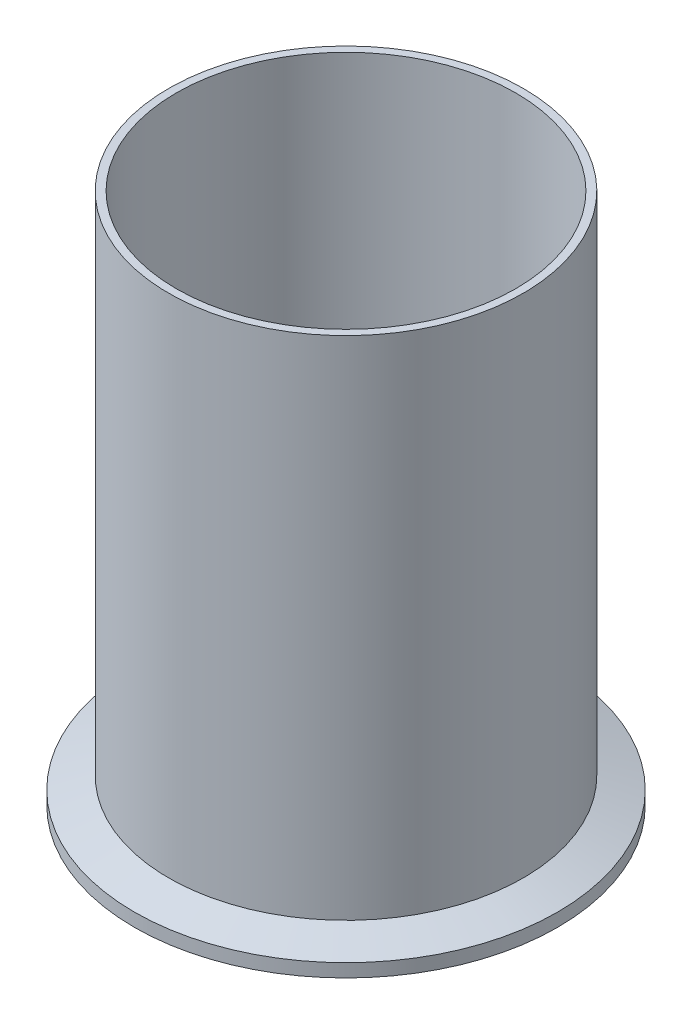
ISO-10303-21;
HEADER;
FILE_DESCRIPTION(('STEP AP214'),'2;1');
FILE_NAME('part.step','',(''),(''),'','','');
FILE_SCHEMA(('AUTOMOTIVE_DESIGN { 1 0 10303 214 1 1 1 1 }'));
ENDSEC;
DATA;
#1=APPLICATION_CONTEXT('core data for automotive mechanical design processes');
#2=APPLICATION_PROTOCOL_DEFINITION('international standard','automotive_design',2000,#1);
#3=PRODUCT_CONTEXT('',#1,'mechanical');
#4=PRODUCT('Part','Part','',(#3));
#5=PRODUCT_RELATED_PRODUCT_CATEGORY('part','',(#4));
#6=PRODUCT_DEFINITION_FORMATION('','',#4);
#7=PRODUCT_DEFINITION_CONTEXT('part definition',#1,'design');
#8=PRODUCT_DEFINITION('design','',#6,#7);
#9=PRODUCT_DEFINITION_SHAPE('','',#8);
#10=(LENGTH_UNIT() NAMED_UNIT(*) SI_UNIT(.MILLI.,.METRE.));
#11=(NAMED_UNIT(*) PLANE_ANGLE_UNIT() SI_UNIT($,.RADIAN.));
#12=(NAMED_UNIT(*) SI_UNIT($,.STERADIAN.) SOLID_ANGLE_UNIT());
#13=UNCERTAINTY_MEASURE_WITH_UNIT(LENGTH_MEASURE(1.E-05),#10,'distance_accuracy_value','');
#14=(GEOMETRIC_REPRESENTATION_CONTEXT(3) GLOBAL_UNCERTAINTY_ASSIGNED_CONTEXT((#13)) GLOBAL_UNIT_ASSIGNED_CONTEXT((#10,
#11,#12)) REPRESENTATION_CONTEXT('',''));
#15=CARTESIAN_POINT('',(0.,0.,0.));
#16=DIRECTION('',(0.,0.,1.));
#17=DIRECTION('',(1.,0.,0.));
#18=AXIS2_PLACEMENT_3D('',#15,#16,#17);
#19=CARTESIAN_POINT('',(0.,0.7874,0.));
#20=DIRECTION('',(0.,-1.,0.));
#21=DIRECTION('',(0.,0.,-1.));
#22=AXIS2_PLACEMENT_3D('',#19,#20,#21);
#23=TOROIDAL_SURFACE('',#22,43.4867084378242,0.787400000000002);
#24=CARTESIAN_POINT('',(0.,0.,0.));
#25=DIRECTION('',(0.,-1.,0.));
#26=DIRECTION('',(0.,0.,-1.));
#27=AXIS2_PLACEMENT_3D('',#24,#25,#26);
#28=CIRCLE('',#27,43.4867084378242);
#29=CARTESIAN_POINT('',(0.,0.,-43.4867084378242));
#30=VERTEX_POINT('',#29);
#31=EDGE_CURVE('E67',#30,#30,#28,.T.);
#32=ORIENTED_EDGE('',*,*,#31,.T.);
#33=EDGE_LOOP('',(#32));
#34=FACE_BOUND('',#33,.T.);
#35=CARTESIAN_POINT('',(0.,0.474458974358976,0.));
#36=DIRECTION('',(0.,-1.,0.));
#37=DIRECTION('',(0.,0.,-1.));
#38=AXIS2_PLACEMENT_3D('',#35,#36,#37);
#39=CIRCLE('',#38,42.7641666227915);
#40=CARTESIAN_POINT('',(0.,0.474458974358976,-42.7641666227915));
#41=VERTEX_POINT('',#40);
#42=EDGE_CURVE('E10',#41,#41,#39,.T.);
#43=ORIENTED_EDGE('',*,*,#42,.F.);
#44=EDGE_LOOP('',(#43));
#45=FACE_BOUND('',#44,.T.);
#46=ADVANCED_FACE('F33',(#34,#45),#23,.T.);
#47=CARTESIAN_POINT('',(0.,0.,0.));
#48=DIRECTION('',(0.,-1.,0.));
#49=DIRECTION('',(0.,0.,-1.));
#50=AXIS2_PLACEMENT_3D('',#47,#48,#49);
#51=TOROIDAL_SURFACE('',#50,41.6687,1.1938);
#52=CARTESIAN_POINT('',(0.,0.474458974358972,0.));
#53=DIRECTION('',(0.,-1.,0.));
#54=DIRECTION('',(0.,0.,-1.));
#55=AXIS2_PLACEMENT_3D('',#52,#53,#54);
#56=CIRCLE('',#55,40.5732333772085);
#57=CARTESIAN_POINT('',(0.,0.474458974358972,-40.5732333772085));
#58=VERTEX_POINT('',#57);
#59=EDGE_CURVE('E39',#58,#58,#56,.T.);
#60=ORIENTED_EDGE('',*,*,#59,.F.);
#61=EDGE_LOOP('',(#60));
#62=FACE_BOUND('',#61,.T.);
#63=ORIENTED_EDGE('',*,*,#42,.T.);
#64=EDGE_LOOP('',(#63));
#65=FACE_BOUND('',#64,.T.);
#66=ADVANCED_FACE('F115',(#62,#65),#51,.F.);
#67=CARTESIAN_POINT('',(0.,0.7874,0.));
#68=DIRECTION('',(0.,-1.,0.));
#69=DIRECTION('',(0.,0.,-1.));
#70=AXIS2_PLACEMENT_3D('',#67,#68,#69);
#71=TOROIDAL_SURFACE('',#70,39.8506915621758,0.787399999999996);
#72=ORIENTED_EDGE('',*,*,#59,.T.);
#73=EDGE_LOOP('',(#72));
#74=FACE_BOUND('',#73,.T.);
#75=CARTESIAN_POINT('',(0.,0.,0.));
#76=DIRECTION('',(0.,-1.,0.));
#77=DIRECTION('',(0.,0.,-1.));
#78=AXIS2_PLACEMENT_3D('',#75,#76,#77);
#79=CIRCLE('',#78,39.8506915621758);
#80=CARTESIAN_POINT('',(0.,0.,-39.8506915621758));
#81=VERTEX_POINT('',#80);
#82=EDGE_CURVE('E43',#81,#81,#79,.T.);
#83=ORIENTED_EDGE('',*,*,#82,.F.);
#84=EDGE_LOOP('',(#83));
#85=FACE_BOUND('',#84,.T.);
#86=ADVANCED_FACE('F111',(#74,#85),#71,.T.);
#87=CARTESIAN_POINT('',(0.,0.,0.));
#88=DIRECTION('',(0.,1.,0.));
#89=DIRECTION('',(0.,0.,1.));
#90=AXIS2_PLACEMENT_3D('',#87,#88,#89);
#91=PLANE('',#90);
#92=CARTESIAN_POINT('',(0.,0.,0.));
#93=DIRECTION('',(0.,-1.,0.));
#94=DIRECTION('',(0.,0.,-1.));
#95=AXIS2_PLACEMENT_3D('',#92,#93,#94);
#96=CIRCLE('',#95,36.449);
#97=CARTESIAN_POINT('',(0.,0.,-36.449));
#98=VERTEX_POINT('',#97);
#99=EDGE_CURVE('E47',#98,#98,#96,.T.);
#100=ORIENTED_EDGE('',*,*,#99,.F.);
#101=EDGE_LOOP('',(#100));
#102=FACE_BOUND('',#101,.T.);
#103=ORIENTED_EDGE('',*,*,#82,.T.);
#104=EDGE_LOOP('',(#103));
#105=FACE_BOUND('',#104,.T.);
#106=ADVANCED_FACE('F105',(#102,#105),#91,.F.);
#107=CARTESIAN_POINT('',(0.,0.,0.));
#108=DIRECTION('',(0.,-1.,0.));
#109=DIRECTION('',(0.,0.,-1.));
#110=AXIS2_PLACEMENT_3D('',#107,#108,#109);
#111=CYLINDRICAL_SURFACE('',#110,36.449);
#112=ORIENTED_EDGE('',*,*,#99,.T.);
#113=EDGE_LOOP('',(#112));
#114=FACE_BOUND('',#113,.T.);
#115=CARTESIAN_POINT('',(0.,114.3,0.));
#116=DIRECTION('',(0.,-1.,0.));
#117=DIRECTION('',(0.,0.,-1.));
#118=AXIS2_PLACEMENT_3D('',#115,#116,#117);
#119=CIRCLE('',#118,36.449);
#120=CARTESIAN_POINT('',(0.,114.3,-36.449));
#121=VERTEX_POINT('',#120);
#122=EDGE_CURVE('E52',#121,#121,#119,.T.);
#123=ORIENTED_EDGE('',*,*,#122,.F.);
#124=EDGE_LOOP('',(#123));
#125=FACE_BOUND('',#124,.T.);
#126=ADVANCED_FACE('F100',(#114,#125),#111,.F.);
#127=CARTESIAN_POINT('',(0.,114.3,0.));
#128=DIRECTION('',(0.,-1.,0.));
#129=DIRECTION('',(0.,0.,-1.));
#130=AXIS2_PLACEMENT_3D('',#127,#128,#129);
#131=PLANE('',#130);
#132=CARTESIAN_POINT('',(0.,114.3,0.));
#133=DIRECTION('',(0.,-1.,0.));
#134=DIRECTION('',(0.,0.,-1.));
#135=AXIS2_PLACEMENT_3D('',#132,#133,#134);
#136=CIRCLE('',#135,38.1);
#137=CARTESIAN_POINT('',(0.,114.3,-38.1));
#138=VERTEX_POINT('',#137);
#139=EDGE_CURVE('E55',#138,#138,#136,.T.);
#140=ORIENTED_EDGE('',*,*,#139,.F.);
#141=EDGE_LOOP('',(#140));
#142=FACE_BOUND('',#141,.T.);
#143=ORIENTED_EDGE('',*,*,#122,.T.);
#144=EDGE_LOOP('',(#143));
#145=FACE_BOUND('',#144,.T.);
#146=ADVANCED_FACE('F94',(#142,#145),#131,.F.);
#147=CARTESIAN_POINT('',(0.,0.,0.));
#148=DIRECTION('',(0.,-1.,0.));
#149=DIRECTION('',(0.,0.,-1.));
#150=AXIS2_PLACEMENT_3D('',#147,#148,#149);
#151=CYLINDRICAL_SURFACE('',#150,38.1);
#152=CARTESIAN_POINT('',(0.,5.52118232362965,0.));
#153=DIRECTION('',(0.,-1.,0.));
#154=DIRECTION('',(0.,0.,-1.));
#155=AXIS2_PLACEMENT_3D('',#152,#153,#154);
#156=CIRCLE('',#155,38.1);
#157=CARTESIAN_POINT('',(0.,5.52118232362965,-38.1));
#158=VERTEX_POINT('',#157);
#159=EDGE_CURVE('E58',#158,#158,#156,.T.);
#160=ORIENTED_EDGE('',*,*,#159,.F.);
#161=EDGE_LOOP('',(#160));
#162=FACE_BOUND('',#161,.T.);
#163=ORIENTED_EDGE('',*,*,#139,.T.);
#164=EDGE_LOOP('',(#163));
#165=FACE_BOUND('',#164,.T.);
#166=ADVANCED_FACE('F88',(#162,#165),#151,.T.);
#167=CARTESIAN_POINT('',(0.,5.52118232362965,0.));
#168=DIRECTION('',(0.,-1.,0.));
#169=DIRECTION('',(0.,0.,-1.));
#170=AXIS2_PLACEMENT_3D('',#167,#168,#169);
#171=CONICAL_SURFACE('',#170,38.1,1.22173047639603);
#172=CARTESIAN_POINT('',(0.,2.8448,0.));
#173=DIRECTION('',(0.,-1.,0.));
#174=DIRECTION('',(0.,0.,-1.));
#175=AXIS2_PLACEMENT_3D('',#172,#173,#174);
#176=CIRCLE('',#175,45.4533);
#177=CARTESIAN_POINT('',(0.,2.8448,-45.4533));
#178=VERTEX_POINT('',#177);
#179=EDGE_CURVE('E61',#178,#178,#176,.T.);
#180=ORIENTED_EDGE('',*,*,#179,.F.);
#181=EDGE_LOOP('',(#180));
#182=FACE_BOUND('',#181,.T.);
#183=ORIENTED_EDGE('',*,*,#159,.T.);
#184=EDGE_LOOP('',(#183));
#185=FACE_BOUND('',#184,.T.);
#186=ADVANCED_FACE('F82',(#182,#185),#171,.T.);
#187=CARTESIAN_POINT('',(0.,0.,0.));
#188=DIRECTION('',(0.,-1.,0.));
#189=DIRECTION('',(0.,0.,-1.));
#190=AXIS2_PLACEMENT_3D('',#187,#188,#189);
#191=CYLINDRICAL_SURFACE('',#190,45.4533);
#192=CARTESIAN_POINT('',(0.,0.,0.));
#193=DIRECTION('',(0.,-1.,0.));
#194=DIRECTION('',(0.,0.,-1.));
#195=AXIS2_PLACEMENT_3D('',#192,#193,#194);
#196=CIRCLE('',#195,45.4533);
#197=CARTESIAN_POINT('',(0.,0.,-45.4533));
#198=VERTEX_POINT('',#197);
#199=EDGE_CURVE('E64',#198,#198,#196,.T.);
#200=ORIENTED_EDGE('',*,*,#199,.F.);
#201=EDGE_LOOP('',(#200));
#202=FACE_BOUND('',#201,.T.);
#203=ORIENTED_EDGE('',*,*,#179,.T.);
#204=EDGE_LOOP('',(#203));
#205=FACE_BOUND('',#204,.T.);
#206=ADVANCED_FACE('F76',(#202,#205),#191,.T.);
#207=CARTESIAN_POINT('',(0.,0.,0.));
#208=DIRECTION('',(0.,1.,0.));
#209=DIRECTION('',(0.,0.,1.));
#210=AXIS2_PLACEMENT_3D('',#207,#208,#209);
#211=PLANE('',#210);
#212=ORIENTED_EDGE('',*,*,#31,.F.);
#213=EDGE_LOOP('',(#212));
#214=FACE_BOUND('',#213,.T.);
#215=ORIENTED_EDGE('',*,*,#199,.T.);
#216=EDGE_LOOP('',(#215));
#217=FACE_BOUND('',#216,.T.);
#218=ADVANCED_FACE('F73',(#214,#217),#211,.F.);
#219=CLOSED_SHELL('',(#46,#66,#86,#106,#126,#146,#166,#186,#206,#218));
#220=MANIFOLD_SOLID_BREP('B2',#219);
#221=ADVANCED_BREP_SHAPE_REPRESENTATION('',(#18,#220),#14);
#222=SHAPE_DEFINITION_REPRESENTATION(#9,#221);
ENDSEC;
END-ISO-10303-21;
